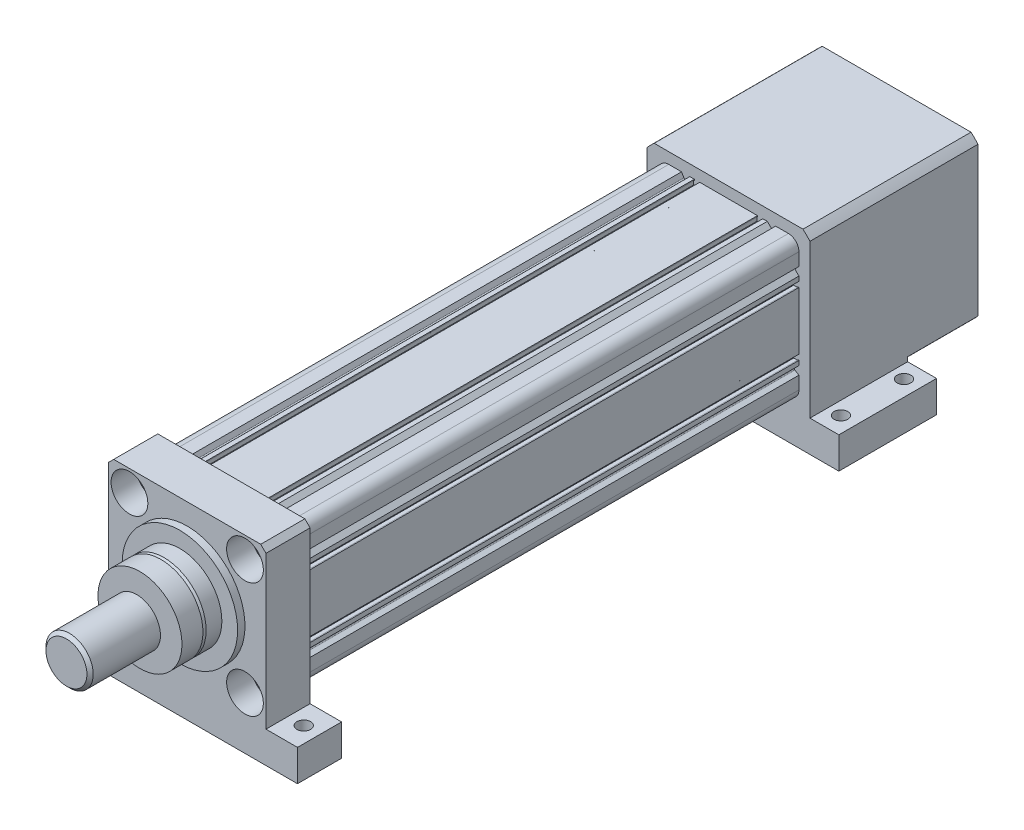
from build123d import *

# Parameters (mm, degrees)
SKETCH_1_R          = 6
EXTRUDE_1_DEPTH     = 473.5
EXTRUDE_1_2_DEPTH   = 42
SKETCH_3_R          = 6.5
SKETCH_3_R_2        = 8.5
CUT_EXTRUDE_1_DEPTH = 42
SKETCH_3_3_R        = 17.5
SKETCH_3_3_R_2      = 8.5
CUT_EXTRUDE_2_DEPTH = 24
SKETCH_3_4_R        = 55
EXTRUDE_2_DEPTH     = 7
SKETCH_4_R          = 40
EXTRUDE_3_DEPTH     = 18
CHAMFER_1_SIZE      = 3
CHAMFER_1_SIZE2     = 1.091910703
SKETCH_5_R          = 40
EXTRUDE_4_DEPTH     = 20
SKETCH_6_R          = 16.5
EXTRUDE_5_DEPTH     = 3
SKETCH_7_R          = 22.5
EXTRUDE_6_DEPTH     = 67
FILLET_1_R          = 1
CHAMFER_2_SIZE      = 3
EXTRUDE_7_DEPTH     = 93
EXTRUDE_8_DEPTH     = 67
SKETCH_10_R         = 65
CUT_EXTRUDE_3_DEPTH = 19
SKETCH_11_R         = 47
CUT_EXTRUDE_4_DEPTH = 47
EXTRUDE_START       = -2.5
SKETCH_12_W         = 210
SKETCH_12_H         = 93
SKETCH_12_R         = 6.5
SKETCH_12_H_2       = 42
EXTRUDE_9_DEPTH     = 30
SKETCH_12_3_W       = 210
SKETCH_12_3_H       = 93
SKETCH_12_3_R       = 6.5
SKETCH_12_3_H_2     = 42
EXTRUDE_10_DEPTH    = 2.5


with BuildPart() as part:
    # Sketch 1 → Extrude 1 (new body)
    with BuildSketch(Plane.XY):
        with BuildLine():
            Line((57, 67), (44.8, 67))
            Line((44.8, 67), (42.56486134, 63.12862628))
            ThreePointArc((42.56486134, 63.12862628), (41.829362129, 62.637181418), (40.991729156, 62.921519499))
            Line((40.991729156, 62.921519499), (36.913248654, 67))
            Line((36.913248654, 67), (32.6, 67))
            Line((32.6, 67), (32.6, 66.1))
            Line((32.6, 66.1), (33.2, 65.5))
            Line((33.2, 65.5), (33.2, 62))
            Line((33.2, 62), (26.9, 62))
            Line((26.9, 62), (26.9, 65.5))
            Line((26.9, 65.5), (27.5, 66.1))
            Line((27.5, 66.1), (27.5, 67))
            Line((27.5, 67), (0, 67))
            Line((0, 67), (-27.5, 67))
            Line((-27.5, 67), (-27.5, 66.1))
            Line((-27.5, 66.1), (-26.9, 65.5))
            Line((-26.9, 65.5), (-26.9, 62))
            Line((-26.9, 62), (-33.2, 62))
            Line((-33.2, 62), (-33.2, 65.5))
            Line((-33.2, 65.5), (-32.6, 66.1))
            Line((-32.6, 66.1), (-32.6, 67))
            Line((-32.6, 67), (-36.913248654, 67))
            Line((-36.913248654, 67), (-40.991729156, 62.921519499))
            ThreePointArc((-40.991729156, 62.921519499), (-41.829362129, 62.637181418), (-42.56486134, 63.12862628))
            Line((-42.56486134, 63.12862628), (-44.8, 67))
            Line((-44.8, 67), (-57, 67))
            ThreePointArc((-57, 67), (-64.071067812, 64.071067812), (-67, 57))
            Line((-67, 57), (-67, 44.8))
            Line((-67, 44.8), (-63.12862628, 42.56486134))
            ThreePointArc((-63.12862628, 42.56486134), (-62.637181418, 41.829362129), (-62.921519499, 40.991729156))
            Line((-62.921519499, 40.991729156), (-67, 36.913248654))
            Line((-67, 36.913248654), (-67, 32.6))
            Line((-67, 32.6), (-66.1, 32.6))
            Line((-66.1, 32.6), (-65.5, 33.2))
            Line((-65.5, 33.2), (-62, 33.2))
            Line((-62, 33.2), (-62, 26.9))
            Line((-62, 26.9), (-65.5, 26.9))
            Line((-65.5, 26.9), (-66.1, 27.5))
            Line((-66.1, 27.5), (-67, 27.5))
            Line((-67, 27.5), (-67, 0))
            Line((-67, 0), (-67, -27.5))
            Line((-67, -27.5), (-66.1, -27.5))
            Line((-66.1, -27.5), (-65.5, -26.9))
            Line((-65.5, -26.9), (-62, -26.9))
            Line((-62, -26.9), (-62, -33.2))
            Line((-62, -33.2), (-65.5, -33.2))
            Line((-65.5, -33.2), (-66.1, -32.6))
            Line((-66.1, -32.6), (-67, -32.6))
            Line((-67, -32.6), (-67, -36.913248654))
            Line((-67, -36.913248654), (-62.921519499, -40.991729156))
            ThreePointArc((-62.921519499, -40.991729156), (-62.637181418, -41.829362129), (-63.12862628, -42.56486134))
            Line((-63.12862628, -42.56486134), (-67, -44.8))
            Line((-67, -44.8), (-67, -57))
            ThreePointArc((-67, -57), (-64.071067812, -64.071067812), (-57, -67))
            Line((-57, -67), (-44.8, -67))
            Line((-44.8, -67), (-42.56486134, -63.12862628))
            ThreePointArc((-42.56486134, -63.12862628), (-41.829362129, -62.637181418), (-40.991729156, -62.921519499))
            Line((-40.991729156, -62.921519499), (-36.913248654, -67))
            Line((-36.913248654, -67), (36.913248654, -67))
            Line((36.913248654, -67), (40.991729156, -62.921519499))
            ThreePointArc((40.991729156, -62.921519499), (41.829362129, -62.637181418), (42.56486134, -63.12862628))
            Line((42.56486134, -63.12862628), (44.8, -67))
            Line((44.8, -67), (57, -67))
            ThreePointArc((57, -67), (64.071067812, -64.071067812), (67, -57))
            Line((67, -57), (67, -44.8))
            Line((67, -44.8), (63.12862628, -42.56486134))
            ThreePointArc((63.12862628, -42.56486134), (62.637181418, -41.829362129), (62.921519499, -40.991729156))
            Line((62.921519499, -40.991729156), (67, -36.913248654))
            Line((67, -36.913248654), (67, -32.6))
            Line((67, -32.6), (66.1, -32.6))
            Line((66.1, -32.6), (65.5, -33.2))
            Line((65.5, -33.2), (62, -33.2))
            Line((62, -33.2), (62, -26.9))
            Line((62, -26.9), (65.5, -26.9))
            Line((65.5, -26.9), (66.1, -27.5))
            Line((66.1, -27.5), (67, -27.5))
            Line((67, -27.5), (67, 0))
            Line((67, 0), (67, 27.5))
            Line((67, 27.5), (66.1, 27.5))
            Line((66.1, 27.5), (65.5, 26.9))
            Line((65.5, 26.9), (62, 26.9))
            Line((62, 26.9), (62, 33.2))
            Line((62, 33.2), (65.5, 33.2))
            Line((65.5, 33.2), (66.1, 32.6))
            Line((66.1, 32.6), (67, 32.6))
            Line((67, 32.6), (67, 36.913248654))
            Line((67, 36.913248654), (62.921519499, 40.991729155))
            ThreePointArc((62.921519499, 40.991729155), (62.637181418, 41.829362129), (63.12862628, 42.56486134))
            Line((63.12862628, 42.56486134), (67, 44.8))
            Line((67, 44.8), (67, 57))
            ThreePointArc((67, 57), (64.071067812, 64.071067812), (57, 67))
        make_face()
        with Locations((-55, 55)):
            Circle(SKETCH_1_R, mode=Mode.SUBTRACT)
        with Locations((55, 55)):
            Circle(SKETCH_1_R, mode=Mode.SUBTRACT)
        with Locations((-55, -55)):
            Circle(SKETCH_1_R, mode=Mode.SUBTRACT)
        with Locations((55, -55)):
            Circle(SKETCH_1_R, mode=Mode.SUBTRACT)
        with BuildLine():
            Line((41.774779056, 51.785063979), (43.601329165, 54.94874157))
            ThreePointArc((43.601329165, 54.94874157), (43.701229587, 55.707560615), (43.235303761, 56.314766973))
            Line((43.235303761, 56.314766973), (39.616756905, 58.403935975))
            ThreePointArc((39.616756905, 58.403935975), (39.337726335, 58.513191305), (39.038853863, 58.534871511))
            Line((39.038853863, 58.534871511), (35.747329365, 58.277670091))
            ThreePointArc((35.747329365, 58.277670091), (35.481311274, 58.1068038), (35.28193171, 57.86142918))
            Line((35.28193171, 57.86142918), (34.274000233, 56.115640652))
            ThreePointArc((34.274000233, 56.115640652), (34.174099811, 55.356821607), (34.640025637, 54.749615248))
            Line((34.640025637, 54.749615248), (40.408753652, 51.419038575))
            ThreePointArc((40.408753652, 51.419038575), (41.167572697, 51.319138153), (41.774779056, 51.785063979))
        make_face(mode=Mode.SUBTRACT)
        with BuildLine():
            Line((51.785063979, 41.774779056), (54.94874157, 43.601329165))
            ThreePointArc((54.94874157, 43.601329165), (55.707560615, 43.701229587), (56.314766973, 43.235303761))
            Line((56.314766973, 43.235303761), (58.403935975, 39.616756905))
            ThreePointArc((58.403935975, 39.616756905), (58.513191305, 39.337726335), (58.534871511, 39.038853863))
            Line((58.534871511, 39.038853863), (58.277670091, 35.747329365))
            ThreePointArc((58.277670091, 35.747329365), (58.1068038, 35.481311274), (57.86142918, 35.28193171))
            Line((57.86142918, 35.28193171), (56.115640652, 34.274000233))
            ThreePointArc((56.115640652, 34.274000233), (55.356821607, 34.174099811), (54.749615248, 34.640025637))
            Line((54.749615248, 34.640025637), (51.419038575, 40.408753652))
            ThreePointArc((51.419038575, 40.408753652), (51.319138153, 41.167572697), (51.785063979, 41.774779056))
        make_face(mode=Mode.SUBTRACT)
        with BuildLine():
            Line((-57.86142918, 35.28193171), (-56.115640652, 34.274000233))
            ThreePointArc((-56.115640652, 34.274000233), (-55.356821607, 34.174099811), (-54.749615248, 34.640025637))
            Line((-54.749615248, 34.640025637), (-51.419038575, 40.408753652))
            ThreePointArc((-51.419038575, 40.408753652), (-51.319138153, 41.167572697), (-51.785063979, 41.774779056))
            Line((-51.785063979, 41.774779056), (-54.94874157, 43.601329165))
            ThreePointArc((-54.94874157, 43.601329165), (-55.707560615, 43.701229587), (-56.314766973, 43.235303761))
            Line((-56.314766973, 43.235303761), (-58.403935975, 39.616756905))
            ThreePointArc((-58.403935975, 39.616756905), (-58.513191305, 39.337726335), (-58.534871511, 39.038853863))
            Line((-58.534871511, 39.038853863), (-58.277670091, 35.747329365))
            ThreePointArc((-58.277670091, 35.747329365), (-58.1068038, 35.481311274), (-57.86142918, 35.28193171))
        make_face(mode=Mode.SUBTRACT)
        with BuildLine():
            Line((-33.360371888, -64.600232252), (-19.423193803, -64.600232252))
            ThreePointArc((-19.423193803, -64.600232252), (-18.434155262, -63.747889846), (-19.1311157, -62.643837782))
            ThreePointArc((-19.1311157, -62.643837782), (-26.690004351, -59.815496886), (-33.843674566, -56.079012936))
            ThreePointArc((-33.843674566, -56.079012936), (-34.851952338, -56.064348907), (-35.360371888, -56.935181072))
            Line((-35.360371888, -56.935181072), (-35.360371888, -62.600232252))
            Line((-35.360371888, -62.600232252), (-33.360371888, -64.600232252))
        make_face(mode=Mode.SUBTRACT)
        with BuildLine():
            Line((35.360371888, -62.600232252), (33.360371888, -64.600232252))
            Line((33.360371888, -64.600232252), (19.423193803, -64.600232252))
            ThreePointArc((19.423193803, -64.600232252), (18.434155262, -63.747889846), (19.1311157, -62.643837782))
            ThreePointArc((19.1311157, -62.643837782), (26.690004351, -59.815496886), (33.843674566, -56.079012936))
            ThreePointArc((33.843674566, -56.079012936), (34.851952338, -56.064348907), (35.360371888, -56.935181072))
            Line((35.360371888, -56.935181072), (35.360371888, -62.600232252))
        make_face(mode=Mode.SUBTRACT)
        with BuildLine():
            Line((51.785063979, -41.774779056), (54.94874157, -43.601329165))
            ThreePointArc((54.94874157, -43.601329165), (55.707560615, -43.701229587), (56.314766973, -43.235303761))
            Line((56.314766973, -43.235303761), (58.403935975, -39.616756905))
            ThreePointArc((58.403935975, -39.616756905), (58.513191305, -39.337726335), (58.534871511, -39.038853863))
            Line((58.534871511, -39.038853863), (58.277670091, -35.747329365))
            ThreePointArc((58.277670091, -35.747329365), (58.1068038, -35.481311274), (57.86142918, -35.28193171))
            Line((57.86142918, -35.28193171), (56.115640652, -34.274000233))
            ThreePointArc((56.115640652, -34.274000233), (55.356821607, -34.174099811), (54.749615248, -34.640025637))
            Line((54.749615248, -34.640025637), (51.419038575, -40.408753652))
            ThreePointArc((51.419038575, -40.408753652), (51.319138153, -41.167572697), (51.785063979, -41.774779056))
        make_face(mode=Mode.SUBTRACT)
        with BuildLine():
            Line((-57.86142918, -35.28193171), (-56.115640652, -34.274000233))
            ThreePointArc((-56.115640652, -34.274000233), (-55.356821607, -34.174099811), (-54.749615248, -34.640025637))
            Line((-54.749615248, -34.640025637), (-51.419038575, -40.408753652))
            ThreePointArc((-51.419038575, -40.408753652), (-51.319138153, -41.167572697), (-51.785063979, -41.774779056))
            Line((-51.785063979, -41.774779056), (-54.94874157, -43.601329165))
            ThreePointArc((-54.94874157, -43.601329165), (-55.707560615, -43.701229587), (-56.314766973, -43.235303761))
            Line((-56.314766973, -43.235303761), (-58.403935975, -39.616756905))
            ThreePointArc((-58.403935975, -39.616756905), (-58.513191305, -39.337726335), (-58.534871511, -39.038853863))
            Line((-58.534871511, -39.038853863), (-58.277670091, -35.747329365))
            ThreePointArc((-58.277670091, -35.747329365), (-58.1068038, -35.481311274), (-57.86142918, -35.28193171))
        make_face(mode=Mode.SUBTRACT)
        with BuildLine():
            Line((-41.774779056, 51.785063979), (-43.601329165, 54.94874157))
            ThreePointArc((-43.601329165, 54.94874157), (-43.701229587, 55.707560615), (-43.235303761, 56.314766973))
            Line((-43.235303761, 56.314766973), (-39.616756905, 58.403935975))
            ThreePointArc((-39.616756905, 58.403935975), (-39.337726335, 58.513191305), (-39.038853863, 58.534871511))
            Line((-39.038853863, 58.534871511), (-35.747329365, 58.277670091))
            ThreePointArc((-35.747329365, 58.277670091), (-35.481311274, 58.1068038), (-35.28193171, 57.86142918))
            Line((-35.28193171, 57.86142918), (-34.274000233, 56.115640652))
            ThreePointArc((-34.274000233, 56.115640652), (-34.174099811, 55.356821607), (-34.640025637, 54.749615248))
            Line((-34.640025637, 54.749615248), (-40.408753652, 51.419038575))
            ThreePointArc((-40.408753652, 51.419038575), (-41.167572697, 51.319138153), (-41.774779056, 51.785063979))
        make_face(mode=Mode.SUBTRACT)
        with BuildLine():
            ThreePointArc((62.5, 0), (0, 62.5), (-62.5, 0))
            ThreePointArc((-62.5, 0), (0, -62.5), (62.5, 0))
        make_face(mode=Mode.SUBTRACT)
    extrude(amount=EXTRUDE_1_DEPTH)

    # Sketch 2 → Extrude 1 2 (add)
    with BuildSketch(Plane.XY.offset(473.5)):
        Polygon((-75, 70), (-70, 75), (70, 75), (75, 70), (75, -70), (75, -75), (70, -75), (-70, -75), (-75, -75), (-75, -70), align=None)
    extrude(amount=EXTRUDE_1_2_DEPTH)

    # Sketch 3 → Cut-Extrude 1 (cut)
    with BuildSketch(Plane.XY.offset(515.5)):
        with Locations((-85, 20)):
            Circle(SKETCH_3_R)
        with Locations((-85, -20)):
            Circle(SKETCH_3_R)
        with Locations((-85, -60)):
            Circle(SKETCH_3_R)
        with Locations((-55, -55)):
            Circle(SKETCH_3_R_2)
        with Locations((-55, 55)):
            Circle(SKETCH_3_R_2)
        with Locations((55, 55)):
            Circle(SKETCH_3_R_2)
        with Locations((85, 60)):
            Circle(SKETCH_3_R)
        with Locations((85, 20)):
            Circle(SKETCH_3_R)
        with Locations((85, -20)):
            Circle(SKETCH_3_R)
        with Locations((85, -60)):
            Circle(SKETCH_3_R)
        with Locations((55, -55)):
            Circle(SKETCH_3_R_2)
        with Locations((-85, 60)):
            Circle(SKETCH_3_R)
    extrude(amount=-CUT_EXTRUDE_1_DEPTH, mode=Mode.SUBTRACT)

    # Sketch 3_3 → Cut-Extrude 2 (cut)
    # profile 1 of 4: a face of its own
    with BuildSketch(Plane.XY.offset(515.5)):
        with Locations((55, 55)):
            Circle(SKETCH_3_3_R)
        with Locations((55, 55)):
            Circle(SKETCH_3_3_R_2, mode=Mode.SUBTRACT)
    # profile 2 of 4: a face of its own
    with BuildSketch(Plane.XY.offset(515.5)):
        with Locations((55, -55)):
            Circle(SKETCH_3_3_R)
        with Locations((55, -55)):
            Circle(SKETCH_3_3_R_2, mode=Mode.SUBTRACT)
    # profile 3 of 4: a face of its own
    with BuildSketch(Plane.XY.offset(515.5)):
        with Locations((-55, -55)):
            Circle(SKETCH_3_3_R)
        with Locations((-55, -55)):
            Circle(SKETCH_3_3_R_2, mode=Mode.SUBTRACT)
    # profile 4 of 4: a face of its own
    with BuildSketch(Plane.XY.offset(515.5)):
        with Locations((-55, 55)):
            Circle(SKETCH_3_3_R)
    extrude(amount=-CUT_EXTRUDE_2_DEPTH, mode=Mode.SUBTRACT)

    # Sketch 3_4 → Extrude 2 (add)
    with BuildSketch(Plane.XY.offset(515.5)):
        with Locations(Location((0, 0, 0), (0, 0, 180))):
            Circle(SKETCH_3_4_R)
    extrude(amount=EXTRUDE_2_DEPTH)

    # Sketch 4 → Extrude 3 (add)
    with BuildSketch(Plane.XY.offset(522.5)):
        Circle(SKETCH_4_R)
    extrude(amount=EXTRUDE_3_DEPTH)

    # Chamfer 1
    chamfer_1_edges = [part.edges().sort_by_distance(p)[0] for p in [
        (-40, 0, 540.5),
    ]]
    chamfer_1_side = [part.faces().sort_by_distance(p)[0] for p in [
        (-40, 0, 531.5),
    ]]
    chamfer(chamfer_1_edges, length=CHAMFER_1_SIZE, length2=CHAMFER_1_SIZE2, reference=chamfer_1_side[0])

    # Sketch 5 → Extrude 4 (add)
    with BuildSketch(Plane.XY.offset(540.5)):
        Circle(SKETCH_5_R)
    extrude(amount=EXTRUDE_4_DEPTH)

    # Sketch 6 → Extrude 5 (add)
    with BuildSketch(Plane.XY.offset(560.5)):
        Circle(SKETCH_6_R)
    extrude(amount=EXTRUDE_5_DEPTH)

    # Sketch 7 → Extrude 6 (add)
    with BuildSketch(Plane.XY.offset(563.5)):
        Circle(SKETCH_7_R)
    extrude(amount=EXTRUDE_6_DEPTH)

    # Fillet 1
    fillet_1_edges = [part.edges().sort_by_distance(p)[0] for p in [
        (-16.5, 0, 560.5),
    ]]
    fillet(fillet_1_edges, radius=FILLET_1_R)

    # Chamfer 2
    chamfer_2_edges = [part.edges().sort_by_distance(p)[0] for p in [
        (-22.5, 0, 630.5),
    ]]
    chamfer(chamfer_2_edges, length=CHAMFER_2_SIZE)

    # Sketch 8 → Extrude 7 (add)
    with BuildSketch(Plane(origin=(0, 0, 0), x_dir=(-1, 0, 0), z_dir=(0, 0, -1))):
        with BuildLine():
            Line((77.5, -70.843136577), (77.5, -77.5))
            Line((77.5, -77.5), (70.843136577, -77.5))
            Line((70.843136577, -77.5), (-70.843136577, -77.5))
            Line((-70.843136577, -77.5), (-77.5, -77.5))
            Line((-77.5, -77.5), (-77.5, -70.843136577))
            Line((-77.5, -70.843136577), (-77.5, 70.843136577))
            ThreePointArc((-77.5, 70.843136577), (-74.246212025, 74.246212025), (-70.843136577, 77.5))
            Line((-70.843136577, 77.5), (70.843136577, 77.5))
            ThreePointArc((70.843136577, 77.5), (74.246212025, 74.246212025), (77.5, 70.843136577))
            Line((77.5, 70.843136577), (77.5, -70.843136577))
        make_face()
    extrude(amount=EXTRUDE_7_DEPTH)

    # Sketch 12 → Extrude 9 (add)
    # profile 1 of 2: a face of its own
    with BuildSketch(Plane.XZ.offset(77.5).offset(EXTRUDE_START)):
        with Locations((0, -46.5)):
            Rectangle(SKETCH_12_W, SKETCH_12_H)
        with Locations(Location((-90, -77, 0), (0, 0, 270))):
            Circle(SKETCH_12_R, mode=Mode.SUBTRACT)
        with Locations(Location((90, -77, 0), (0, 0, 270))):
            Circle(SKETCH_12_R, mode=Mode.SUBTRACT)
        with Locations(Location((-90, -17, 0), (0, 0, 270))):
            Circle(SKETCH_12_R, mode=Mode.SUBTRACT)
        with Locations(Location((90, -17, 0), (0, 0, 270))):
            Circle(SKETCH_12_R, mode=Mode.SUBTRACT)
    # profile 2 of 2: a face of its own
    with BuildSketch(Plane.XZ.offset(77.5).offset(EXTRUDE_START)):
        with Locations((0, 494.5)):
            Rectangle(SKETCH_12_W, SKETCH_12_H_2)
        with Locations(Location((-90, 494.5, 0), (0, 0, 270))):
            Circle(SKETCH_12_R, mode=Mode.SUBTRACT)
        with Locations(Location((90, 494.5, 0), (0, 0, 270))):
            Circle(SKETCH_12_R, mode=Mode.SUBTRACT)
    extrude(amount=EXTRUDE_9_DEPTH)



with BuildPart() as body_2:
    # Sketch 9 → Extrude 8 (new body)
    with BuildSketch(Plane(origin=(0, 0, -93), x_dir=(-1, 0, 0), z_dir=(0, 0, -1))):
        with BuildLine():
            Line((-70.843136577, 77.5), (70.843136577, 77.5))
            ThreePointArc((70.843136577, 77.5), (74.246212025, 74.246212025), (77.5, 70.843136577))
            Line((77.5, 70.843136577), (77.5, -70.843136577))
            ThreePointArc((77.5, -70.843136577), (74.246212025, -74.246212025), (70.843136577, -77.5))
            Line((70.843136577, -77.5), (-70.843136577, -77.5))
            ThreePointArc((-70.843136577, -77.5), (-74.246212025, -74.246212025), (-77.5, -70.843136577))
            Line((-77.5, -70.843136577), (-77.5, 70.843136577))
            ThreePointArc((-77.5, 70.843136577), (-74.246212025, 74.246212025), (-70.843136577, 77.5))
        make_face()
    extrude(amount=EXTRUDE_8_DEPTH)

    # Sketch 10 → Cut-Extrude 3 (cut)
    with BuildSketch(Plane(origin=(0, 0, -160), x_dir=(-1, 0, 0), z_dir=(0, 0, -1))):
        Circle(SKETCH_10_R)
    extrude(amount=-CUT_EXTRUDE_3_DEPTH, mode=Mode.SUBTRACT)

    # Sketch 11 → Cut-Extrude 4 (cut)
    with BuildSketch(Plane(origin=(0, 0, -141), x_dir=(-1, 0, 0), z_dir=(0, 0, -1))):
        Circle(SKETCH_11_R)
    extrude(amount=-CUT_EXTRUDE_4_DEPTH, mode=Mode.SUBTRACT)


with BuildPart() as part_1:
    add(part.part)

    add(body_2.part)  # Extrude 10 merges body 2
    # Sketch 12_3 → Extrude 10 (add)
    # profile 1 of 2: a face of its own
    with BuildSketch(Plane.XZ.offset(77.5).offset(EXTRUDE_START)):
        with Locations((0, -46.5)):
            Rectangle(SKETCH_12_3_W, SKETCH_12_3_H)
        with Locations(Location((-90, -77, 0), (0, 0, 270))):
            Circle(SKETCH_12_3_R, mode=Mode.SUBTRACT)
        with Locations(Location((90, -77, 0), (0, 0, 270))):
            Circle(SKETCH_12_3_R, mode=Mode.SUBTRACT)
        with Locations(Location((-90, -17, 0), (0, 0, 270))):
            Circle(SKETCH_12_3_R, mode=Mode.SUBTRACT)
        with Locations(Location((90, -17, 0), (0, 0, 270))):
            Circle(SKETCH_12_3_R, mode=Mode.SUBTRACT)
    # profile 2 of 2: a face of its own
    with BuildSketch(Plane.XZ.offset(77.5).offset(EXTRUDE_START)):
        with Locations((0, 494.5)):
            Rectangle(SKETCH_12_3_W, SKETCH_12_3_H_2)
        with Locations(Location((-90, 494.5, 0), (0, 0, 270))):
            Circle(SKETCH_12_3_R, mode=Mode.SUBTRACT)
        with Locations(Location((90, 494.5, 0), (0, 0, 270))):
            Circle(SKETCH_12_3_R, mode=Mode.SUBTRACT)
    extrude(amount=EXTRUDE_10_DEPTH)


solid = part_1.part
